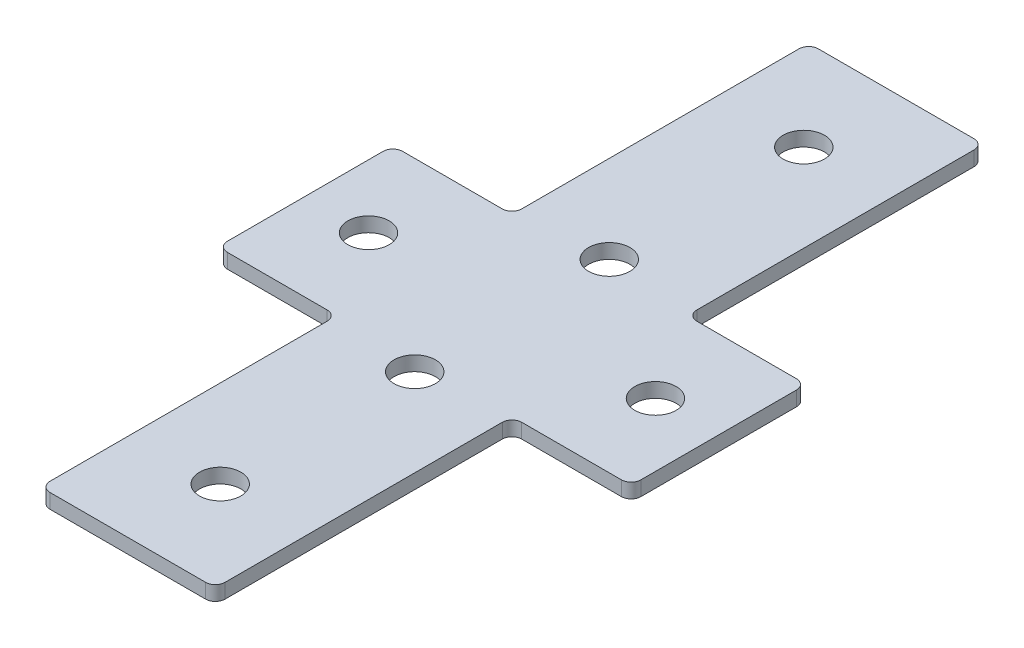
ISO-10303-21;
HEADER;
FILE_DESCRIPTION(('STEP AP214'),'2;1');
FILE_NAME('part.step','',(''),(''),'','','');
FILE_SCHEMA(('AUTOMOTIVE_DESIGN { 1 0 10303 214 1 1 1 1 }'));
ENDSEC;
DATA;
#1=APPLICATION_CONTEXT('core data for automotive mechanical design processes');
#2=APPLICATION_PROTOCOL_DEFINITION('international standard','automotive_design',2000,#1);
#3=PRODUCT_CONTEXT('',#1,'mechanical');
#4=PRODUCT('Part','Part','',(#3));
#5=PRODUCT_RELATED_PRODUCT_CATEGORY('part','',(#4));
#6=PRODUCT_DEFINITION_FORMATION('','',#4);
#7=PRODUCT_DEFINITION_CONTEXT('part definition',#1,'design');
#8=PRODUCT_DEFINITION('design','',#6,#7);
#9=PRODUCT_DEFINITION_SHAPE('','',#8);
#10=(LENGTH_UNIT() NAMED_UNIT(*) SI_UNIT(.MILLI.,.METRE.));
#11=(NAMED_UNIT(*) PLANE_ANGLE_UNIT() SI_UNIT($,.RADIAN.));
#12=(NAMED_UNIT(*) SI_UNIT($,.STERADIAN.) SOLID_ANGLE_UNIT());
#13=UNCERTAINTY_MEASURE_WITH_UNIT(LENGTH_MEASURE(1.E-05),#10,'distance_accuracy_value','');
#14=(GEOMETRIC_REPRESENTATION_CONTEXT(3) GLOBAL_UNCERTAINTY_ASSIGNED_CONTEXT((#13)) GLOBAL_UNIT_ASSIGNED_CONTEXT((#10,
#11,#12)) REPRESENTATION_CONTEXT('',''));
#15=CARTESIAN_POINT('',(0.,0.,0.));
#16=DIRECTION('',(0.,0.,1.));
#17=DIRECTION('',(1.,0.,0.));
#18=AXIS2_PLACEMENT_3D('',#15,#16,#17);
#19=CARTESIAN_POINT('',(0.,3.,0.));
#20=DIRECTION('',(0.,1.,0.));
#21=DIRECTION('',(0.,0.,1.));
#22=AXIS2_PLACEMENT_3D('',#19,#20,#21);
#23=PLANE('',#22);
#24=CARTESIAN_POINT('',(-29.5,3.,0.));
#25=DIRECTION('',(0.,1.,0.));
#26=DIRECTION('',(0.,0.,1.));
#27=AXIS2_PLACEMENT_3D('',#24,#25,#26);
#28=CIRCLE('',#27,4.25);
#29=CARTESIAN_POINT('',(-29.5,3.,4.25));
#30=VERTEX_POINT('',#29);
#31=EDGE_CURVE('E771',#30,#30,#28,.T.);
#32=ORIENTED_EDGE('',*,*,#31,.F.);
#33=EDGE_LOOP('',(#32));
#34=FACE_BOUND('',#33,.T.);
#35=CARTESIAN_POINT('',(0.,3.,19.9999999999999));
#36=DIRECTION('',(0.,1.,0.));
#37=DIRECTION('',(0.,0.,-1.));
#38=AXIS2_PLACEMENT_3D('',#35,#36,#37);
#39=CIRCLE('',#38,4.25);
#40=CARTESIAN_POINT('',(0.,3.,15.7499999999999));
#41=VERTEX_POINT('',#40);
#42=EDGE_CURVE('E760',#41,#41,#39,.T.);
#43=ORIENTED_EDGE('',*,*,#42,.F.);
#44=EDGE_LOOP('',(#43));
#45=FACE_BOUND('',#44,.T.);
#46=CARTESIAN_POINT('',(0.,3.,-59.9999999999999));
#47=DIRECTION('',(0.,1.,0.));
#48=DIRECTION('',(0.,0.,1.));
#49=AXIS2_PLACEMENT_3D('',#46,#47,#48);
#50=CIRCLE('',#49,4.25);
#51=CARTESIAN_POINT('',(0.,3.,-55.7499999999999));
#52=VERTEX_POINT('',#51);
#53=EDGE_CURVE('E379',#52,#52,#50,.T.);
#54=ORIENTED_EDGE('',*,*,#53,.F.);
#55=EDGE_LOOP('',(#54));
#56=FACE_BOUND('',#55,.T.);
#57=DIRECTION('',(0.,0.,1.));
#58=VECTOR('',#57,1.);
#59=CARTESIAN_POINT('',(-18.,3.,18.));
#60=LINE('',#59,#58);
#61=CARTESIAN_POINT('',(-18.,3.,20.));
#62=VERTEX_POINT('',#61);
#63=CARTESIAN_POINT('',(-18.,3.,77.));
#64=VERTEX_POINT('',#63);
#65=EDGE_CURVE('E394',#62,#64,#60,.T.);
#66=ORIENTED_EDGE('',*,*,#65,.T.);
#67=CARTESIAN_POINT('',(-16.,3.,77.));
#68=DIRECTION('',(0.,1.,0.));
#69=DIRECTION('',(0.,0.,1.));
#70=AXIS2_PLACEMENT_3D('',#67,#68,#69);
#71=CIRCLE('',#70,2.);
#72=CARTESIAN_POINT('',(-16.,3.,79.));
#73=VERTEX_POINT('',#72);
#74=EDGE_CURVE('E283',#64,#73,#71,.T.);
#75=ORIENTED_EDGE('',*,*,#74,.T.);
#76=DIRECTION('',(1.,0.,0.));
#77=VECTOR('',#76,1.);
#78=CARTESIAN_POINT('',(-18.,3.,79.));
#79=LINE('',#78,#77);
#80=CARTESIAN_POINT('',(16.0000000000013,3.,78.9999999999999));
#81=VERTEX_POINT('',#80);
#82=EDGE_CURVE('E219',#73,#81,#79,.T.);
#83=ORIENTED_EDGE('',*,*,#82,.T.);
#84=CARTESIAN_POINT('',(16.0000000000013,3.,76.9999999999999));
#85=DIRECTION('',(0.,1.,0.));
#86=DIRECTION('',(0.,0.,1.));
#87=AXIS2_PLACEMENT_3D('',#84,#85,#86);
#88=CIRCLE('',#87,2.);
#89=CARTESIAN_POINT('',(18.0000000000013,3.,76.9999999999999));
#90=VERTEX_POINT('',#89);
#91=EDGE_CURVE('E281',#81,#90,#88,.T.);
#92=ORIENTED_EDGE('',*,*,#91,.T.);
#93=DIRECTION('',(0.,0.,-1.));
#94=VECTOR('',#93,1.);
#95=CARTESIAN_POINT('',(18.0000000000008,3.,17.9999999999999));
#96=LINE('',#95,#94);
#97=CARTESIAN_POINT('',(18.0000000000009,3.,19.9999999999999));
#98=VERTEX_POINT('',#97);
#99=EDGE_CURVE('E399',#90,#98,#96,.T.);
#100=ORIENTED_EDGE('',*,*,#99,.T.);
#101=CARTESIAN_POINT('',(20.0000000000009,3.,19.9999999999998));
#102=DIRECTION('',(0.,1.,0.));
#103=DIRECTION('',(0.,0.,1.));
#104=AXIS2_PLACEMENT_3D('',#101,#102,#103);
#105=CIRCLE('',#104,2.);
#106=CARTESIAN_POINT('',(20.0000000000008,3.,17.9999999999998));
#107=VERTEX_POINT('',#106);
#108=EDGE_CURVE('E336',#98,#107,#105,.F.);
#109=ORIENTED_EDGE('',*,*,#108,.T.);
#110=DIRECTION('',(1.,0.,0.));
#111=VECTOR('',#110,1.);
#112=CARTESIAN_POINT('',(42.5000000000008,3.,17.9999999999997));
#113=LINE('',#112,#111);
#114=CARTESIAN_POINT('',(40.5000000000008,3.,17.9999999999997));
#115=VERTEX_POINT('',#114);
#116=EDGE_CURVE('E407',#107,#115,#113,.T.);
#117=ORIENTED_EDGE('',*,*,#116,.T.);
#118=CARTESIAN_POINT('',(40.5000000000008,3.,15.9999999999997));
#119=DIRECTION('',(0.,1.,0.));
#120=DIRECTION('',(0.,0.,1.));
#121=AXIS2_PLACEMENT_3D('',#118,#119,#120);
#122=CIRCLE('',#121,2.);
#123=CARTESIAN_POINT('',(42.5000000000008,3.,15.9999999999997));
#124=VERTEX_POINT('',#123);
#125=EDGE_CURVE('E279',#115,#124,#122,.T.);
#126=ORIENTED_EDGE('',*,*,#125,.T.);
#127=DIRECTION('',(0.,0.,-1.));
#128=VECTOR('',#127,1.);
#129=CARTESIAN_POINT('',(42.5000000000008,3.,17.9999999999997));
#130=LINE('',#129,#128);
#131=CARTESIAN_POINT('',(42.5000000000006,3.,-16.0000000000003));
#132=VERTEX_POINT('',#131);
#133=EDGE_CURVE('E370',#124,#132,#130,.T.);
#134=ORIENTED_EDGE('',*,*,#133,.T.);
#135=CARTESIAN_POINT('',(40.5000000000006,3.,-16.0000000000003));
#136=DIRECTION('',(0.,1.,0.));
#137=DIRECTION('',(0.,0.,1.));
#138=AXIS2_PLACEMENT_3D('',#135,#136,#137);
#139=CIRCLE('',#138,2.);
#140=CARTESIAN_POINT('',(40.5000000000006,3.,-18.0000000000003));
#141=VERTEX_POINT('',#140);
#142=EDGE_CURVE('E275',#132,#141,#139,.T.);
#143=ORIENTED_EDGE('',*,*,#142,.T.);
#144=DIRECTION('',(-1.,0.,0.));
#145=VECTOR('',#144,1.);
#146=CARTESIAN_POINT('',(42.5000000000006,3.,-18.0000000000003));
#147=LINE('',#146,#145);
#148=CARTESIAN_POINT('',(20.0000000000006,3.,-18.0000000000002));
#149=VERTEX_POINT('',#148);
#150=EDGE_CURVE('E363',#141,#149,#147,.T.);
#151=ORIENTED_EDGE('',*,*,#150,.T.);
#152=CARTESIAN_POINT('',(20.0000000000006,3.,-20.0000000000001));
#153=DIRECTION('',(0.,1.,0.));
#154=DIRECTION('',(0.,0.,1.));
#155=AXIS2_PLACEMENT_3D('',#152,#153,#154);
#156=CIRCLE('',#155,2.);
#157=CARTESIAN_POINT('',(18.0000000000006,3.,-20.0000000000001));
#158=VERTEX_POINT('',#157);
#159=EDGE_CURVE('E11',#149,#158,#156,.F.);
#160=ORIENTED_EDGE('',*,*,#159,.T.);
#161=DIRECTION('',(0.,0.,-1.));
#162=VECTOR('',#161,1.);
#163=CARTESIAN_POINT('',(18.0000000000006,3.,-18.0000000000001));
#164=LINE('',#163,#162);
#165=CARTESIAN_POINT('',(18.0000000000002,3.,-77.0000000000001));
#166=VERTEX_POINT('',#165);
#167=EDGE_CURVE('E361',#158,#166,#164,.T.);
#168=ORIENTED_EDGE('',*,*,#167,.T.);
#169=CARTESIAN_POINT('',(16.0000000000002,3.,-77.0000000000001));
#170=DIRECTION('',(0.,1.,0.));
#171=DIRECTION('',(0.,0.,1.));
#172=AXIS2_PLACEMENT_3D('',#169,#170,#171);
#173=CIRCLE('',#172,2.);
#174=CARTESIAN_POINT('',(16.0000000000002,3.,-79.0000000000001));
#175=VERTEX_POINT('',#174);
#176=EDGE_CURVE('E271',#166,#175,#173,.T.);
#177=ORIENTED_EDGE('',*,*,#176,.T.);
#178=DIRECTION('',(-1.,0.,0.));
#179=VECTOR('',#178,1.);
#180=CARTESIAN_POINT('',(-18.,3.,-79.));
#181=LINE('',#180,#179);
#182=CARTESIAN_POINT('',(-16.,3.,-79.));
#183=VERTEX_POINT('',#182);
#184=EDGE_CURVE('E367',#175,#183,#181,.T.);
#185=ORIENTED_EDGE('',*,*,#184,.T.);
#186=CARTESIAN_POINT('',(-16.,3.,-77.));
#187=DIRECTION('',(0.,1.,0.));
#188=DIRECTION('',(0.,0.,1.));
#189=AXIS2_PLACEMENT_3D('',#186,#187,#188);
#190=CIRCLE('',#189,2.);
#191=CARTESIAN_POINT('',(-18.,3.,-77.));
#192=VERTEX_POINT('',#191);
#193=EDGE_CURVE('E59',#183,#192,#190,.T.);
#194=ORIENTED_EDGE('',*,*,#193,.T.);
#195=DIRECTION('',(0.,0.,1.));
#196=VECTOR('',#195,1.);
#197=CARTESIAN_POINT('',(-18.,3.,-18.));
#198=LINE('',#197,#196);
#199=CARTESIAN_POINT('',(-18.,3.,-20.));
#200=VERTEX_POINT('',#199);
#201=EDGE_CURVE('E253',#192,#200,#198,.T.);
#202=ORIENTED_EDGE('',*,*,#201,.T.);
#203=CARTESIAN_POINT('',(-20.,3.,-20.));
#204=DIRECTION('',(0.,1.,0.));
#205=DIRECTION('',(0.,0.,1.));
#206=AXIS2_PLACEMENT_3D('',#203,#204,#205);
#207=CIRCLE('',#206,2.);
#208=CARTESIAN_POINT('',(-20.,3.,-18.));
#209=VERTEX_POINT('',#208);
#210=EDGE_CURVE('E344',#200,#209,#207,.F.);
#211=ORIENTED_EDGE('',*,*,#210,.T.);
#212=DIRECTION('',(-1.,0.,0.));
#213=VECTOR('',#212,1.);
#214=CARTESIAN_POINT('',(-42.5,3.,-18.));
#215=LINE('',#214,#213);
#216=CARTESIAN_POINT('',(-40.5,3.,-18.));
#217=VERTEX_POINT('',#216);
#218=EDGE_CURVE('E252',#209,#217,#215,.T.);
#219=ORIENTED_EDGE('',*,*,#218,.T.);
#220=CARTESIAN_POINT('',(-40.5,3.,-16.));
#221=DIRECTION('',(0.,1.,0.));
#222=DIRECTION('',(0.,0.,1.));
#223=AXIS2_PLACEMENT_3D('',#220,#221,#222);
#224=CIRCLE('',#223,2.);
#225=CARTESIAN_POINT('',(-42.5,3.,-16.));
#226=VERTEX_POINT('',#225);
#227=EDGE_CURVE('E273',#217,#226,#224,.T.);
#228=ORIENTED_EDGE('',*,*,#227,.T.);
#229=DIRECTION('',(0.,0.,1.));
#230=VECTOR('',#229,1.);
#231=CARTESIAN_POINT('',(-42.5,3.,18.));
#232=LINE('',#231,#230);
#233=CARTESIAN_POINT('',(-42.5,3.,16.));
#234=VERTEX_POINT('',#233);
#235=EDGE_CURVE('E401',#226,#234,#232,.T.);
#236=ORIENTED_EDGE('',*,*,#235,.T.);
#237=CARTESIAN_POINT('',(-40.5,3.,16.));
#238=DIRECTION('',(0.,1.,0.));
#239=DIRECTION('',(0.,0.,1.));
#240=AXIS2_PLACEMENT_3D('',#237,#238,#239);
#241=CIRCLE('',#240,2.);
#242=CARTESIAN_POINT('',(-40.5,3.,18.));
#243=VERTEX_POINT('',#242);
#244=EDGE_CURVE('E277',#234,#243,#241,.T.);
#245=ORIENTED_EDGE('',*,*,#244,.T.);
#246=DIRECTION('',(1.,0.,0.));
#247=VECTOR('',#246,1.);
#248=CARTESIAN_POINT('',(-42.5,3.,18.));
#249=LINE('',#248,#247);
#250=CARTESIAN_POINT('',(-20.,3.,18.));
#251=VERTEX_POINT('',#250);
#252=EDGE_CURVE('E395',#243,#251,#249,.T.);
#253=ORIENTED_EDGE('',*,*,#252,.T.);
#254=CARTESIAN_POINT('',(-20.,3.,20.));
#255=DIRECTION('',(0.,1.,0.));
#256=DIRECTION('',(0.,0.,1.));
#257=AXIS2_PLACEMENT_3D('',#254,#255,#256);
#258=CIRCLE('',#257,2.);
#259=EDGE_CURVE('E340',#251,#62,#258,.F.);
#260=ORIENTED_EDGE('',*,*,#259,.T.);
#261=EDGE_LOOP('',(#66,#75,#83,#92,#100,#109,#117,#126,#134,#143,#151,#160,#168,#177,#185,#194,
#202,#211,#219,#228,#236,#245,#253,#260));
#262=FACE_BOUND('',#261,.T.);
#263=CARTESIAN_POINT('',(0.,3.,-19.9999999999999));
#264=DIRECTION('',(0.,1.,0.));
#265=DIRECTION('',(0.,0.,1.));
#266=AXIS2_PLACEMENT_3D('',#263,#264,#265);
#267=CIRCLE('',#266,4.25);
#268=CARTESIAN_POINT('',(0.,3.,-15.7499999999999));
#269=VERTEX_POINT('',#268);
#270=EDGE_CURVE('E746',#269,#269,#267,.T.);
#271=ORIENTED_EDGE('',*,*,#270,.F.);
#272=EDGE_LOOP('',(#271));
#273=FACE_BOUND('',#272,.T.);
#274=CARTESIAN_POINT('',(0.,3.,59.9999999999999));
#275=DIRECTION('',(0.,1.,0.));
#276=DIRECTION('',(0.,0.,-1.));
#277=AXIS2_PLACEMENT_3D('',#274,#275,#276);
#278=CIRCLE('',#277,4.25);
#279=CARTESIAN_POINT('',(0.,3.,55.7499999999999));
#280=VERTEX_POINT('',#279);
#281=EDGE_CURVE('E765',#280,#280,#278,.T.);
#282=ORIENTED_EDGE('',*,*,#281,.F.);
#283=EDGE_LOOP('',(#282));
#284=FACE_BOUND('',#283,.T.);
#285=CARTESIAN_POINT('',(29.5000000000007,3.,-1.94289029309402E-13));
#286=DIRECTION('',(0.,1.,0.));
#287=DIRECTION('',(0.,0.,-1.));
#288=AXIS2_PLACEMENT_3D('',#285,#286,#287);
#289=CIRCLE('',#288,4.25);
#290=CARTESIAN_POINT('',(29.5000000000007,3.,-4.2500000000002));
#291=VERTEX_POINT('',#290);
#292=EDGE_CURVE('E777',#291,#291,#289,.T.);
#293=ORIENTED_EDGE('',*,*,#292,.F.);
#294=EDGE_LOOP('',(#293));
#295=FACE_BOUND('',#294,.T.);
#296=ADVANCED_FACE('F37',(#34,#45,#56,#262,#273,#284,#295),#23,.T.);
#297=CARTESIAN_POINT('',(0.,0.,0.));
#298=DIRECTION('',(0.,1.,0.));
#299=DIRECTION('',(0.,0.,1.));
#300=AXIS2_PLACEMENT_3D('',#297,#298,#299);
#301=PLANE('',#300);
#302=CARTESIAN_POINT('',(-29.5,0.,0.));
#303=DIRECTION('',(0.,1.,0.));
#304=DIRECTION('',(0.,0.,1.));
#305=AXIS2_PLACEMENT_3D('',#302,#303,#304);
#306=CIRCLE('',#305,4.25);
#307=CARTESIAN_POINT('',(-29.5,0.,4.25));
#308=VERTEX_POINT('',#307);
#309=EDGE_CURVE('E774',#308,#308,#306,.T.);
#310=ORIENTED_EDGE('',*,*,#309,.T.);
#311=EDGE_LOOP('',(#310));
#312=FACE_BOUND('',#311,.T.);
#313=CARTESIAN_POINT('',(0.,0.,19.9999999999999));
#314=DIRECTION('',(0.,1.,0.));
#315=DIRECTION('',(0.,0.,-1.));
#316=AXIS2_PLACEMENT_3D('',#313,#314,#315);
#317=CIRCLE('',#316,4.25);
#318=CARTESIAN_POINT('',(0.,0.,15.7499999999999));
#319=VERTEX_POINT('',#318);
#320=EDGE_CURVE('E762',#319,#319,#317,.T.);
#321=ORIENTED_EDGE('',*,*,#320,.T.);
#322=EDGE_LOOP('',(#321));
#323=FACE_BOUND('',#322,.T.);
#324=CARTESIAN_POINT('',(0.,0.,-59.9999999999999));
#325=DIRECTION('',(0.,1.,0.));
#326=DIRECTION('',(0.,0.,1.));
#327=AXIS2_PLACEMENT_3D('',#324,#325,#326);
#328=CIRCLE('',#327,4.25);
#329=CARTESIAN_POINT('',(0.,0.,-55.7499999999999));
#330=VERTEX_POINT('',#329);
#331=EDGE_CURVE('E744',#330,#330,#328,.T.);
#332=ORIENTED_EDGE('',*,*,#331,.T.);
#333=EDGE_LOOP('',(#332));
#334=FACE_BOUND('',#333,.T.);
#335=DIRECTION('',(1.,0.,0.));
#336=VECTOR('',#335,1.);
#337=CARTESIAN_POINT('',(-18.,0.,79.));
#338=LINE('',#337,#336);
#339=CARTESIAN_POINT('',(-16.,0.,79.));
#340=VERTEX_POINT('',#339);
#341=CARTESIAN_POINT('',(16.0000000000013,0.,78.9999999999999));
#342=VERTEX_POINT('',#341);
#343=EDGE_CURVE('E216',#340,#342,#338,.T.);
#344=ORIENTED_EDGE('',*,*,#343,.F.);
#345=CARTESIAN_POINT('',(-16.,0.,77.));
#346=DIRECTION('',(0.,1.,0.));
#347=DIRECTION('',(0.,0.,1.));
#348=AXIS2_PLACEMENT_3D('',#345,#346,#347);
#349=CIRCLE('',#348,2.);
#350=CARTESIAN_POINT('',(-18.,0.,77.));
#351=VERTEX_POINT('',#350);
#352=EDGE_CURVE('E199',#340,#351,#349,.F.);
#353=ORIENTED_EDGE('',*,*,#352,.T.);
#354=DIRECTION('',(0.,0.,1.));
#355=VECTOR('',#354,1.);
#356=CARTESIAN_POINT('',(-18.,0.,18.));
#357=LINE('',#356,#355);
#358=CARTESIAN_POINT('',(-18.,0.,20.));
#359=VERTEX_POINT('',#358);
#360=EDGE_CURVE('E227',#359,#351,#357,.T.);
#361=ORIENTED_EDGE('',*,*,#360,.F.);
#362=CARTESIAN_POINT('',(-20.,0.,20.));
#363=DIRECTION('',(0.,1.,0.));
#364=DIRECTION('',(0.,0.,1.));
#365=AXIS2_PLACEMENT_3D('',#362,#363,#364);
#366=CIRCLE('',#365,2.);
#367=CARTESIAN_POINT('',(-20.,0.,18.));
#368=VERTEX_POINT('',#367);
#369=EDGE_CURVE('E338',#359,#368,#366,.T.);
#370=ORIENTED_EDGE('',*,*,#369,.T.);
#371=DIRECTION('',(1.,0.,0.));
#372=VECTOR('',#371,1.);
#373=CARTESIAN_POINT('',(-42.5,0.,18.));
#374=LINE('',#373,#372);
#375=CARTESIAN_POINT('',(-40.5,0.,18.));
#376=VERTEX_POINT('',#375);
#377=EDGE_CURVE('E232',#376,#368,#374,.T.);
#378=ORIENTED_EDGE('',*,*,#377,.F.);
#379=CARTESIAN_POINT('',(-40.5,0.,16.));
#380=DIRECTION('',(0.,1.,0.));
#381=DIRECTION('',(0.,0.,1.));
#382=AXIS2_PLACEMENT_3D('',#379,#380,#381);
#383=CIRCLE('',#382,2.);
#384=CARTESIAN_POINT('',(-42.5,0.,16.));
#385=VERTEX_POINT('',#384);
#386=EDGE_CURVE('E262',#376,#385,#383,.F.);
#387=ORIENTED_EDGE('',*,*,#386,.T.);
#388=DIRECTION('',(0.,0.,1.));
#389=VECTOR('',#388,1.);
#390=CARTESIAN_POINT('',(-42.5,0.,18.));
#391=LINE('',#390,#389);
#392=CARTESIAN_POINT('',(-42.5,0.,-16.));
#393=VERTEX_POINT('',#392);
#394=EDGE_CURVE('E378',#393,#385,#391,.T.);
#395=ORIENTED_EDGE('',*,*,#394,.F.);
#396=CARTESIAN_POINT('',(-40.5,0.,-16.));
#397=DIRECTION('',(0.,1.,0.));
#398=DIRECTION('',(0.,0.,1.));
#399=AXIS2_PLACEMENT_3D('',#396,#397,#398);
#400=CIRCLE('',#399,2.);
#401=CARTESIAN_POINT('',(-40.5,0.,-18.));
#402=VERTEX_POINT('',#401);
#403=EDGE_CURVE('E258',#393,#402,#400,.F.);
#404=ORIENTED_EDGE('',*,*,#403,.T.);
#405=DIRECTION('',(-1.,0.,0.));
#406=VECTOR('',#405,1.);
#407=CARTESIAN_POINT('',(-42.5,0.,-18.));
#408=LINE('',#407,#406);
#409=CARTESIAN_POINT('',(-20.,0.,-18.));
#410=VERTEX_POINT('',#409);
#411=EDGE_CURVE('E375',#410,#402,#408,.T.);
#412=ORIENTED_EDGE('',*,*,#411,.F.);
#413=CARTESIAN_POINT('',(-20.,0.,-20.));
#414=DIRECTION('',(0.,1.,0.));
#415=DIRECTION('',(0.,0.,1.));
#416=AXIS2_PLACEMENT_3D('',#413,#414,#415);
#417=CIRCLE('',#416,2.);
#418=CARTESIAN_POINT('',(-18.,0.,-20.));
#419=VERTEX_POINT('',#418);
#420=EDGE_CURVE('E342',#410,#419,#417,.T.);
#421=ORIENTED_EDGE('',*,*,#420,.T.);
#422=DIRECTION('',(0.,0.,1.));
#423=VECTOR('',#422,1.);
#424=CARTESIAN_POINT('',(-18.,0.,-18.));
#425=LINE('',#424,#423);
#426=CARTESIAN_POINT('',(-18.,0.,-77.));
#427=VERTEX_POINT('',#426);
#428=EDGE_CURVE('E250',#427,#419,#425,.T.);
#429=ORIENTED_EDGE('',*,*,#428,.F.);
#430=CARTESIAN_POINT('',(-16.,0.,-77.));
#431=DIRECTION('',(0.,1.,0.));
#432=DIRECTION('',(0.,0.,1.));
#433=AXIS2_PLACEMENT_3D('',#430,#431,#432);
#434=CIRCLE('',#433,2.);
#435=CARTESIAN_POINT('',(-16.,0.,-79.));
#436=VERTEX_POINT('',#435);
#437=EDGE_CURVE('E220',#427,#436,#434,.F.);
#438=ORIENTED_EDGE('',*,*,#437,.T.);
#439=DIRECTION('',(-1.,0.,0.));
#440=VECTOR('',#439,1.);
#441=CARTESIAN_POINT('',(-18.,0.,-79.));
#442=LINE('',#441,#440);
#443=CARTESIAN_POINT('',(16.0000000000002,0.,-79.0000000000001));
#444=VERTEX_POINT('',#443);
#445=EDGE_CURVE('E247',#444,#436,#442,.T.);
#446=ORIENTED_EDGE('',*,*,#445,.F.);
#447=CARTESIAN_POINT('',(16.0000000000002,0.,-77.0000000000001));
#448=DIRECTION('',(0.,1.,0.));
#449=DIRECTION('',(0.,0.,1.));
#450=AXIS2_PLACEMENT_3D('',#447,#448,#449);
#451=CIRCLE('',#450,2.);
#452=CARTESIAN_POINT('',(18.0000000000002,0.,-77.0000000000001));
#453=VERTEX_POINT('',#452);
#454=EDGE_CURVE('E256',#444,#453,#451,.F.);
#455=ORIENTED_EDGE('',*,*,#454,.T.);
#456=DIRECTION('',(0.,0.,-1.));
#457=VECTOR('',#456,1.);
#458=CARTESIAN_POINT('',(18.0000000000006,0.,-18.0000000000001));
#459=LINE('',#458,#457);
#460=CARTESIAN_POINT('',(18.0000000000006,0.,-20.0000000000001));
#461=VERTEX_POINT('',#460);
#462=EDGE_CURVE('E244',#461,#453,#459,.T.);
#463=ORIENTED_EDGE('',*,*,#462,.F.);
#464=CARTESIAN_POINT('',(20.0000000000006,0.,-20.0000000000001));
#465=DIRECTION('',(0.,1.,0.));
#466=DIRECTION('',(0.,0.,1.));
#467=AXIS2_PLACEMENT_3D('',#464,#465,#466);
#468=CIRCLE('',#467,2.);
#469=CARTESIAN_POINT('',(20.0000000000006,0.,-18.0000000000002));
#470=VERTEX_POINT('',#469);
#471=EDGE_CURVE('E45',#461,#470,#468,.T.);
#472=ORIENTED_EDGE('',*,*,#471,.T.);
#473=DIRECTION('',(-1.,0.,0.));
#474=VECTOR('',#473,1.);
#475=CARTESIAN_POINT('',(42.5000000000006,0.,-18.0000000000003));
#476=LINE('',#475,#474);
#477=CARTESIAN_POINT('',(40.5000000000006,0.,-18.0000000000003));
#478=VERTEX_POINT('',#477);
#479=EDGE_CURVE('E241',#478,#470,#476,.T.);
#480=ORIENTED_EDGE('',*,*,#479,.F.);
#481=CARTESIAN_POINT('',(40.5000000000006,0.,-16.0000000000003));
#482=DIRECTION('',(0.,1.,0.));
#483=DIRECTION('',(0.,0.,1.));
#484=AXIS2_PLACEMENT_3D('',#481,#482,#483);
#485=CIRCLE('',#484,2.);
#486=CARTESIAN_POINT('',(42.5000000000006,0.,-16.0000000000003));
#487=VERTEX_POINT('',#486);
#488=EDGE_CURVE('E260',#478,#487,#485,.F.);
#489=ORIENTED_EDGE('',*,*,#488,.T.);
#490=DIRECTION('',(0.,0.,-1.));
#491=VECTOR('',#490,1.);
#492=CARTESIAN_POINT('',(42.5000000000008,0.,17.9999999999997));
#493=LINE('',#492,#491);
#494=CARTESIAN_POINT('',(42.5000000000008,0.,15.9999999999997));
#495=VERTEX_POINT('',#494);
#496=EDGE_CURVE('E238',#495,#487,#493,.T.);
#497=ORIENTED_EDGE('',*,*,#496,.F.);
#498=CARTESIAN_POINT('',(40.5000000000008,0.,15.9999999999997));
#499=DIRECTION('',(0.,1.,0.));
#500=DIRECTION('',(0.,0.,1.));
#501=AXIS2_PLACEMENT_3D('',#498,#499,#500);
#502=CIRCLE('',#501,2.);
#503=CARTESIAN_POINT('',(40.5000000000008,0.,17.9999999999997));
#504=VERTEX_POINT('',#503);
#505=EDGE_CURVE('E264',#495,#504,#502,.F.);
#506=ORIENTED_EDGE('',*,*,#505,.T.);
#507=DIRECTION('',(1.,0.,0.));
#508=VECTOR('',#507,1.);
#509=CARTESIAN_POINT('',(42.5000000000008,0.,17.9999999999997));
#510=LINE('',#509,#508);
#511=CARTESIAN_POINT('',(20.0000000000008,0.,17.9999999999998));
#512=VERTEX_POINT('',#511);
#513=EDGE_CURVE('E230',#512,#504,#510,.T.);
#514=ORIENTED_EDGE('',*,*,#513,.F.);
#515=CARTESIAN_POINT('',(20.0000000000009,0.,19.9999999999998));
#516=DIRECTION('',(0.,1.,0.));
#517=DIRECTION('',(0.,0.,1.));
#518=AXIS2_PLACEMENT_3D('',#515,#516,#517);
#519=CIRCLE('',#518,2.);
#520=CARTESIAN_POINT('',(18.0000000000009,0.,19.9999999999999));
#521=VERTEX_POINT('',#520);
#522=EDGE_CURVE('E334',#512,#521,#519,.T.);
#523=ORIENTED_EDGE('',*,*,#522,.T.);
#524=DIRECTION('',(0.,0.,-1.));
#525=VECTOR('',#524,1.);
#526=CARTESIAN_POINT('',(18.0000000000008,0.,17.9999999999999));
#527=LINE('',#526,#525);
#528=CARTESIAN_POINT('',(18.0000000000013,0.,76.9999999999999));
#529=VERTEX_POINT('',#528);
#530=EDGE_CURVE('E226',#529,#521,#527,.T.);
#531=ORIENTED_EDGE('',*,*,#530,.F.);
#532=CARTESIAN_POINT('',(16.0000000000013,0.,76.9999999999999));
#533=DIRECTION('',(0.,1.,0.));
#534=DIRECTION('',(0.,0.,1.));
#535=AXIS2_PLACEMENT_3D('',#532,#533,#534);
#536=CIRCLE('',#535,2.);
#537=EDGE_CURVE('E210',#529,#342,#536,.F.);
#538=ORIENTED_EDGE('',*,*,#537,.T.);
#539=EDGE_LOOP('',(#344,#353,#361,#370,#378,#387,#395,#404,#412,#421,#429,#438,#446,#455,#463,
#472,#480,#489,#497,#506,#514,#523,#531,#538));
#540=FACE_BOUND('',#539,.T.);
#541=CARTESIAN_POINT('',(0.,0.,-19.9999999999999));
#542=DIRECTION('',(0.,1.,0.));
#543=DIRECTION('',(0.,0.,1.));
#544=AXIS2_PLACEMENT_3D('',#541,#542,#543);
#545=CIRCLE('',#544,4.25);
#546=CARTESIAN_POINT('',(0.,0.,-15.7499999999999));
#547=VERTEX_POINT('',#546);
#548=EDGE_CURVE('E750',#547,#547,#545,.T.);
#549=ORIENTED_EDGE('',*,*,#548,.T.);
#550=EDGE_LOOP('',(#549));
#551=FACE_BOUND('',#550,.T.);
#552=CARTESIAN_POINT('',(0.,0.,59.9999999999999));
#553=DIRECTION('',(0.,1.,0.));
#554=DIRECTION('',(0.,0.,-1.));
#555=AXIS2_PLACEMENT_3D('',#552,#553,#554);
#556=CIRCLE('',#555,4.25);
#557=CARTESIAN_POINT('',(0.,0.,55.7499999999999));
#558=VERTEX_POINT('',#557);
#559=EDGE_CURVE('E768',#558,#558,#556,.T.);
#560=ORIENTED_EDGE('',*,*,#559,.T.);
#561=EDGE_LOOP('',(#560));
#562=FACE_BOUND('',#561,.T.);
#563=CARTESIAN_POINT('',(29.5000000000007,0.,-1.94289029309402E-13));
#564=DIRECTION('',(0.,1.,0.));
#565=DIRECTION('',(0.,0.,-1.));
#566=AXIS2_PLACEMENT_3D('',#563,#564,#565);
#567=CIRCLE('',#566,4.25);
#568=CARTESIAN_POINT('',(29.5000000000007,0.,-4.2500000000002));
#569=VERTEX_POINT('',#568);
#570=EDGE_CURVE('E780',#569,#569,#567,.T.);
#571=ORIENTED_EDGE('',*,*,#570,.T.);
#572=EDGE_LOOP('',(#571));
#573=FACE_BOUND('',#572,.T.);
#574=ADVANCED_FACE('F223',(#312,#323,#334,#540,#551,#562,#573),#301,.F.);
#575=CARTESIAN_POINT('',(-42.5,3.,-18.));
#576=DIRECTION('',(0.,0.,1.));
#577=DIRECTION('',(1.,0.,0.));
#578=AXIS2_PLACEMENT_3D('',#575,#576,#577);
#579=PLANE('',#578);
#580=ORIENTED_EDGE('',*,*,#218,.F.);
#581=DIRECTION('',(0.,-1.,0.));
#582=VECTOR('',#581,1.);
#583=CARTESIAN_POINT('',(-20.,0.,-18.));
#584=LINE('',#583,#582);
#585=EDGE_CURVE('E312',#209,#410,#584,.T.);
#586=ORIENTED_EDGE('',*,*,#585,.T.);
#587=ORIENTED_EDGE('',*,*,#411,.T.);
#588=DIRECTION('',(0.,-1.,0.));
#589=VECTOR('',#588,1.);
#590=CARTESIAN_POINT('',(-40.5,3.,-18.));
#591=LINE('',#590,#589);
#592=EDGE_CURVE('E310',#402,#217,#591,.F.);
#593=ORIENTED_EDGE('',*,*,#592,.T.);
#594=EDGE_LOOP('',(#580,#586,#587,#593));
#595=FACE_BOUND('',#594,.T.);
#596=ADVANCED_FACE('F454',(#595),#579,.F.);
#597=CARTESIAN_POINT('',(-42.5,3.,18.));
#598=DIRECTION('',(1.,0.,0.));
#599=DIRECTION('',(0.,0.,-1.));
#600=AXIS2_PLACEMENT_3D('',#597,#598,#599);
#601=PLANE('',#600);
#602=ORIENTED_EDGE('',*,*,#394,.T.);
#603=DIRECTION('',(0.,-1.,0.));
#604=VECTOR('',#603,1.);
#605=CARTESIAN_POINT('',(-42.5,3.,16.));
#606=LINE('',#605,#604);
#607=EDGE_CURVE('E308',#385,#234,#606,.F.);
#608=ORIENTED_EDGE('',*,*,#607,.T.);
#609=ORIENTED_EDGE('',*,*,#235,.F.);
#610=DIRECTION('',(0.,-1.,0.));
#611=VECTOR('',#610,1.);
#612=CARTESIAN_POINT('',(-42.5,3.,-16.));
#613=LINE('',#612,#611);
#614=EDGE_CURVE('E305',#226,#393,#613,.T.);
#615=ORIENTED_EDGE('',*,*,#614,.T.);
#616=EDGE_LOOP('',(#602,#608,#609,#615));
#617=FACE_BOUND('',#616,.T.);
#618=ADVANCED_FACE('F486',(#617),#601,.F.);
#619=CARTESIAN_POINT('',(-42.5,3.,18.));
#620=DIRECTION('',(0.,0.,-1.));
#621=DIRECTION('',(-1.,0.,0.));
#622=AXIS2_PLACEMENT_3D('',#619,#620,#621);
#623=PLANE('',#622);
#624=ORIENTED_EDGE('',*,*,#377,.T.);
#625=DIRECTION('',(0.,-1.,0.));
#626=VECTOR('',#625,1.);
#627=CARTESIAN_POINT('',(-20.,3.,18.));
#628=LINE('',#627,#626);
#629=EDGE_CURVE('E303',#368,#251,#628,.F.);
#630=ORIENTED_EDGE('',*,*,#629,.T.);
#631=ORIENTED_EDGE('',*,*,#252,.F.);
#632=DIRECTION('',(0.,-1.,0.));
#633=VECTOR('',#632,1.);
#634=CARTESIAN_POINT('',(-40.5,3.,18.));
#635=LINE('',#634,#633);
#636=EDGE_CURVE('E300',#243,#376,#635,.T.);
#637=ORIENTED_EDGE('',*,*,#636,.T.);
#638=EDGE_LOOP('',(#624,#630,#631,#637));
#639=FACE_BOUND('',#638,.T.);
#640=ADVANCED_FACE('F385',(#639),#623,.F.);
#641=CARTESIAN_POINT('',(-18.,3.,18.));
#642=DIRECTION('',(1.,0.,0.));
#643=DIRECTION('',(0.,0.,-1.));
#644=AXIS2_PLACEMENT_3D('',#641,#642,#643);
#645=PLANE('',#644);
#646=ORIENTED_EDGE('',*,*,#360,.T.);
#647=DIRECTION('',(0.,-1.,0.));
#648=VECTOR('',#647,1.);
#649=CARTESIAN_POINT('',(-18.,3.,77.));
#650=LINE('',#649,#648);
#651=EDGE_CURVE('E204',#351,#64,#650,.F.);
#652=ORIENTED_EDGE('',*,*,#651,.T.);
#653=ORIENTED_EDGE('',*,*,#65,.F.);
#654=DIRECTION('',(0.,-1.,0.));
#655=VECTOR('',#654,1.);
#656=CARTESIAN_POINT('',(-18.,0.,20.));
#657=LINE('',#656,#655);
#658=EDGE_CURVE('E209',#62,#359,#657,.T.);
#659=ORIENTED_EDGE('',*,*,#658,.T.);
#660=EDGE_LOOP('',(#646,#652,#653,#659));
#661=FACE_BOUND('',#660,.T.);
#662=ADVANCED_FACE('F397',(#661),#645,.F.);
#663=CARTESIAN_POINT('',(-18.,3.,79.));
#664=DIRECTION('',(0.,0.,-1.));
#665=DIRECTION('',(-1.,0.,0.));
#666=AXIS2_PLACEMENT_3D('',#663,#664,#665);
#667=PLANE('',#666);
#668=ORIENTED_EDGE('',*,*,#82,.F.);
#669=DIRECTION('',(0.,-1.,0.));
#670=VECTOR('',#669,1.);
#671=CARTESIAN_POINT('',(-16.,3.,79.));
#672=LINE('',#671,#670);
#673=EDGE_CURVE('E203',#73,#340,#672,.T.);
#674=ORIENTED_EDGE('',*,*,#673,.T.);
#675=ORIENTED_EDGE('',*,*,#343,.T.);
#676=DIRECTION('',(0.,-1.,0.));
#677=VECTOR('',#676,1.);
#678=CARTESIAN_POINT('',(16.0000000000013,3.,78.9999999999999));
#679=LINE('',#678,#677);
#680=EDGE_CURVE('E221',#342,#81,#679,.F.);
#681=ORIENTED_EDGE('',*,*,#680,.T.);
#682=EDGE_LOOP('',(#668,#674,#675,#681));
#683=FACE_BOUND('',#682,.T.);
#684=ADVANCED_FACE('F215',(#683),#667,.F.);
#685=CARTESIAN_POINT('',(18.0000000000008,3.,17.9999999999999));
#686=DIRECTION('',(-1.,0.,0.));
#687=DIRECTION('',(0.,0.,1.));
#688=AXIS2_PLACEMENT_3D('',#685,#686,#687);
#689=PLANE('',#688);
#690=ORIENTED_EDGE('',*,*,#99,.F.);
#691=DIRECTION('',(0.,-1.,0.));
#692=VECTOR('',#691,1.);
#693=CARTESIAN_POINT('',(18.0000000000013,3.,76.9999999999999));
#694=LINE('',#693,#692);
#695=EDGE_CURVE('E287',#90,#529,#694,.T.);
#696=ORIENTED_EDGE('',*,*,#695,.T.);
#697=ORIENTED_EDGE('',*,*,#530,.T.);
#698=DIRECTION('',(0.,-1.,0.));
#699=VECTOR('',#698,1.);
#700=CARTESIAN_POINT('',(18.0000000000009,3.,19.9999999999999));
#701=LINE('',#700,#699);
#702=EDGE_CURVE('E285',#521,#98,#701,.F.);
#703=ORIENTED_EDGE('',*,*,#702,.T.);
#704=EDGE_LOOP('',(#690,#696,#697,#703));
#705=FACE_BOUND('',#704,.T.);
#706=ADVANCED_FACE('F434',(#705),#689,.F.);
#707=CARTESIAN_POINT('',(42.5000000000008,3.,17.9999999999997));
#708=DIRECTION('',(0.,0.,-1.));
#709=DIRECTION('',(-1.,0.,0.));
#710=AXIS2_PLACEMENT_3D('',#707,#708,#709);
#711=PLANE('',#710);
#712=ORIENTED_EDGE('',*,*,#513,.T.);
#713=DIRECTION('',(0.,-1.,0.));
#714=VECTOR('',#713,1.);
#715=CARTESIAN_POINT('',(40.5000000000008,3.,17.9999999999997));
#716=LINE('',#715,#714);
#717=EDGE_CURVE('E298',#504,#115,#716,.F.);
#718=ORIENTED_EDGE('',*,*,#717,.T.);
#719=ORIENTED_EDGE('',*,*,#116,.F.);
#720=DIRECTION('',(0.,-1.,0.));
#721=VECTOR('',#720,1.);
#722=CARTESIAN_POINT('',(20.0000000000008,0.,17.9999999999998));
#723=LINE('',#722,#721);
#724=EDGE_CURVE('E295',#107,#512,#723,.T.);
#725=ORIENTED_EDGE('',*,*,#724,.T.);
#726=EDGE_LOOP('',(#712,#718,#719,#725));
#727=FACE_BOUND('',#726,.T.);
#728=ADVANCED_FACE('F425',(#727),#711,.F.);
#729=CARTESIAN_POINT('',(42.5000000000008,3.,17.9999999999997));
#730=DIRECTION('',(-1.,0.,0.));
#731=DIRECTION('',(0.,0.,1.));
#732=AXIS2_PLACEMENT_3D('',#729,#730,#731);
#733=PLANE('',#732);
#734=ORIENTED_EDGE('',*,*,#133,.F.);
#735=DIRECTION('',(0.,-1.,0.));
#736=VECTOR('',#735,1.);
#737=CARTESIAN_POINT('',(42.5000000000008,3.,15.9999999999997));
#738=LINE('',#737,#736);
#739=EDGE_CURVE('E292',#124,#495,#738,.T.);
#740=ORIENTED_EDGE('',*,*,#739,.T.);
#741=ORIENTED_EDGE('',*,*,#496,.T.);
#742=DIRECTION('',(0.,-1.,0.));
#743=VECTOR('',#742,1.);
#744=CARTESIAN_POINT('',(42.5000000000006,3.,-16.0000000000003));
#745=LINE('',#744,#743);
#746=EDGE_CURVE('E290',#487,#132,#745,.F.);
#747=ORIENTED_EDGE('',*,*,#746,.T.);
#748=EDGE_LOOP('',(#734,#740,#741,#747));
#749=FACE_BOUND('',#748,.T.);
#750=ADVANCED_FACE('F419',(#749),#733,.F.);
#751=CARTESIAN_POINT('',(42.5000000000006,3.,-18.0000000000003));
#752=DIRECTION('',(0.,0.,1.));
#753=DIRECTION('',(1.,0.,0.));
#754=AXIS2_PLACEMENT_3D('',#751,#752,#753);
#755=PLANE('',#754);
#756=ORIENTED_EDGE('',*,*,#479,.T.);
#757=DIRECTION('',(0.,-1.,0.));
#758=VECTOR('',#757,1.);
#759=CARTESIAN_POINT('',(20.0000000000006,3.,-18.0000000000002));
#760=LINE('',#759,#758);
#761=EDGE_CURVE('E327',#470,#149,#760,.F.);
#762=ORIENTED_EDGE('',*,*,#761,.T.);
#763=ORIENTED_EDGE('',*,*,#150,.F.);
#764=DIRECTION('',(0.,-1.,0.));
#765=VECTOR('',#764,1.);
#766=CARTESIAN_POINT('',(40.5000000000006,3.,-18.0000000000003));
#767=LINE('',#766,#765);
#768=EDGE_CURVE('E324',#141,#478,#767,.T.);
#769=ORIENTED_EDGE('',*,*,#768,.T.);
#770=EDGE_LOOP('',(#756,#762,#763,#769));
#771=FACE_BOUND('',#770,.T.);
#772=ADVANCED_FACE('F351',(#771),#755,.F.);
#773=CARTESIAN_POINT('',(18.0000000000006,3.,-18.0000000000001));
#774=DIRECTION('',(-1.,0.,0.));
#775=DIRECTION('',(0.,0.,1.));
#776=AXIS2_PLACEMENT_3D('',#773,#774,#775);
#777=PLANE('',#776);
#778=ORIENTED_EDGE('',*,*,#167,.F.);
#779=DIRECTION('',(0.,-1.,0.));
#780=VECTOR('',#779,1.);
#781=CARTESIAN_POINT('',(18.0000000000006,0.,-20.0000000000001));
#782=LINE('',#781,#780);
#783=EDGE_CURVE('E321',#158,#461,#782,.T.);
#784=ORIENTED_EDGE('',*,*,#783,.T.);
#785=ORIENTED_EDGE('',*,*,#462,.T.);
#786=DIRECTION('',(0.,-1.,0.));
#787=VECTOR('',#786,1.);
#788=CARTESIAN_POINT('',(18.0000000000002,3.,-77.0000000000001));
#789=LINE('',#788,#787);
#790=EDGE_CURVE('E319',#453,#166,#789,.F.);
#791=ORIENTED_EDGE('',*,*,#790,.T.);
#792=EDGE_LOOP('',(#778,#784,#785,#791));
#793=FACE_BOUND('',#792,.T.);
#794=ADVANCED_FACE('F365',(#793),#777,.F.);
#795=CARTESIAN_POINT('',(-18.,3.,-79.));
#796=DIRECTION('',(0.,0.,1.));
#797=DIRECTION('',(1.,0.,0.));
#798=AXIS2_PLACEMENT_3D('',#795,#796,#797);
#799=PLANE('',#798);
#800=ORIENTED_EDGE('',*,*,#184,.F.);
#801=DIRECTION('',(0.,-1.,0.));
#802=VECTOR('',#801,1.);
#803=CARTESIAN_POINT('',(16.0000000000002,3.,-79.0000000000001));
#804=LINE('',#803,#802);
#805=EDGE_CURVE('E331',#175,#444,#804,.T.);
#806=ORIENTED_EDGE('',*,*,#805,.T.);
#807=ORIENTED_EDGE('',*,*,#445,.T.);
#808=DIRECTION('',(0.,-1.,0.));
#809=VECTOR('',#808,1.);
#810=CARTESIAN_POINT('',(-16.,3.,-79.));
#811=LINE('',#810,#809);
#812=EDGE_CURVE('E329',#436,#183,#811,.F.);
#813=ORIENTED_EDGE('',*,*,#812,.T.);
#814=EDGE_LOOP('',(#800,#806,#807,#813));
#815=FACE_BOUND('',#814,.T.);
#816=ADVANCED_FACE('F466',(#815),#799,.F.);
#817=CARTESIAN_POINT('',(-18.,3.,-18.));
#818=DIRECTION('',(1.,0.,0.));
#819=DIRECTION('',(0.,0.,-1.));
#820=AXIS2_PLACEMENT_3D('',#817,#818,#819);
#821=PLANE('',#820);
#822=ORIENTED_EDGE('',*,*,#428,.T.);
#823=DIRECTION('',(0.,-1.,0.));
#824=VECTOR('',#823,1.);
#825=CARTESIAN_POINT('',(-18.,3.,-20.));
#826=LINE('',#825,#824);
#827=EDGE_CURVE('E52',#419,#200,#826,.F.);
#828=ORIENTED_EDGE('',*,*,#827,.T.);
#829=ORIENTED_EDGE('',*,*,#201,.F.);
#830=DIRECTION('',(0.,-1.,0.));
#831=VECTOR('',#830,1.);
#832=CARTESIAN_POINT('',(-18.,3.,-77.));
#833=LINE('',#832,#831);
#834=EDGE_CURVE('E315',#192,#427,#833,.T.);
#835=ORIENTED_EDGE('',*,*,#834,.T.);
#836=EDGE_LOOP('',(#822,#828,#829,#835));
#837=FACE_BOUND('',#836,.T.);
#838=ADVANCED_FACE('F463',(#837),#821,.F.);
#839=CARTESIAN_POINT('',(0.,3.,-59.9999999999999));
#840=DIRECTION('',(0.,-1.,0.));
#841=DIRECTION('',(0.,0.,-1.));
#842=AXIS2_PLACEMENT_3D('',#839,#840,#841);
#843=CYLINDRICAL_SURFACE('',#842,4.25);
#844=ORIENTED_EDGE('',*,*,#53,.T.);
#845=EDGE_LOOP('',(#844));
#846=FACE_BOUND('',#845,.T.);
#847=ORIENTED_EDGE('',*,*,#331,.F.);
#848=EDGE_LOOP('',(#847));
#849=FACE_BOUND('',#848,.T.);
#850=ADVANCED_FACE('F460',(#846,#849),#843,.F.);
#851=CARTESIAN_POINT('',(0.,3.,-19.9999999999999));
#852=DIRECTION('',(0.,-1.,0.));
#853=DIRECTION('',(0.,0.,-1.));
#854=AXIS2_PLACEMENT_3D('',#851,#852,#853);
#855=CYLINDRICAL_SURFACE('',#854,4.25);
#856=ORIENTED_EDGE('',*,*,#270,.T.);
#857=EDGE_LOOP('',(#856));
#858=FACE_BOUND('',#857,.T.);
#859=ORIENTED_EDGE('',*,*,#548,.F.);
#860=EDGE_LOOP('',(#859));
#861=FACE_BOUND('',#860,.T.);
#862=ADVANCED_FACE('F636',(#858,#861),#855,.F.);
#863=CARTESIAN_POINT('',(0.,3.,19.9999999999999));
#864=DIRECTION('',(0.,-1.,0.));
#865=DIRECTION('',(0.,0.,-1.));
#866=AXIS2_PLACEMENT_3D('',#863,#864,#865);
#867=CYLINDRICAL_SURFACE('',#866,4.25);
#868=ORIENTED_EDGE('',*,*,#42,.T.);
#869=EDGE_LOOP('',(#868));
#870=FACE_BOUND('',#869,.T.);
#871=ORIENTED_EDGE('',*,*,#320,.F.);
#872=EDGE_LOOP('',(#871));
#873=FACE_BOUND('',#872,.T.);
#874=ADVANCED_FACE('F627',(#870,#873),#867,.F.);
#875=CARTESIAN_POINT('',(0.,3.,59.9999999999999));
#876=DIRECTION('',(0.,-1.,0.));
#877=DIRECTION('',(0.,0.,-1.));
#878=AXIS2_PLACEMENT_3D('',#875,#876,#877);
#879=CYLINDRICAL_SURFACE('',#878,4.25);
#880=ORIENTED_EDGE('',*,*,#281,.T.);
#881=EDGE_LOOP('',(#880));
#882=FACE_BOUND('',#881,.T.);
#883=ORIENTED_EDGE('',*,*,#559,.F.);
#884=EDGE_LOOP('',(#883));
#885=FACE_BOUND('',#884,.T.);
#886=ADVANCED_FACE('F618',(#882,#885),#879,.F.);
#887=CARTESIAN_POINT('',(-29.5,3.,0.));
#888=DIRECTION('',(0.,-1.,0.));
#889=DIRECTION('',(0.,0.,-1.));
#890=AXIS2_PLACEMENT_3D('',#887,#888,#889);
#891=CYLINDRICAL_SURFACE('',#890,4.25);
#892=ORIENTED_EDGE('',*,*,#31,.T.);
#893=EDGE_LOOP('',(#892));
#894=FACE_BOUND('',#893,.T.);
#895=ORIENTED_EDGE('',*,*,#309,.F.);
#896=EDGE_LOOP('',(#895));
#897=FACE_BOUND('',#896,.T.);
#898=ADVANCED_FACE('F609',(#894,#897),#891,.F.);
#899=CARTESIAN_POINT('',(29.5000000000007,3.,-1.94289029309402E-13));
#900=DIRECTION('',(0.,-1.,0.));
#901=DIRECTION('',(0.,0.,-1.));
#902=AXIS2_PLACEMENT_3D('',#899,#900,#901);
#903=CYLINDRICAL_SURFACE('',#902,4.25);
#904=ORIENTED_EDGE('',*,*,#292,.T.);
#905=EDGE_LOOP('',(#904));
#906=FACE_BOUND('',#905,.T.);
#907=ORIENTED_EDGE('',*,*,#570,.F.);
#908=EDGE_LOOP('',(#907));
#909=FACE_BOUND('',#908,.T.);
#910=ADVANCED_FACE('F446',(#906,#909),#903,.F.);
#911=CARTESIAN_POINT('',(-16.,3.,77.));
#912=DIRECTION('',(0.,-1.,0.));
#913=DIRECTION('',(0.,0.,-1.));
#914=AXIS2_PLACEMENT_3D('',#911,#912,#913);
#915=CYLINDRICAL_SURFACE('',#914,2.);
#916=ORIENTED_EDGE('',*,*,#74,.F.);
#917=ORIENTED_EDGE('',*,*,#651,.F.);
#918=ORIENTED_EDGE('',*,*,#352,.F.);
#919=ORIENTED_EDGE('',*,*,#673,.F.);
#920=EDGE_LOOP('',(#916,#917,#918,#919));
#921=FACE_BOUND('',#920,.T.);
#922=ADVANCED_FACE('F202',(#921),#915,.T.);
#923=CARTESIAN_POINT('',(16.0000000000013,3.,76.9999999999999));
#924=DIRECTION('',(0.,-1.,0.));
#925=DIRECTION('',(0.,0.,-1.));
#926=AXIS2_PLACEMENT_3D('',#923,#924,#925);
#927=CYLINDRICAL_SURFACE('',#926,2.);
#928=ORIENTED_EDGE('',*,*,#91,.F.);
#929=ORIENTED_EDGE('',*,*,#680,.F.);
#930=ORIENTED_EDGE('',*,*,#537,.F.);
#931=ORIENTED_EDGE('',*,*,#695,.F.);
#932=EDGE_LOOP('',(#928,#929,#930,#931));
#933=FACE_BOUND('',#932,.T.);
#934=ADVANCED_FACE('F438',(#933),#927,.T.);
#935=CARTESIAN_POINT('',(40.5000000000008,3.,15.9999999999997));
#936=DIRECTION('',(0.,-1.,0.));
#937=DIRECTION('',(0.,0.,-1.));
#938=AXIS2_PLACEMENT_3D('',#935,#936,#937);
#939=CYLINDRICAL_SURFACE('',#938,2.);
#940=ORIENTED_EDGE('',*,*,#125,.F.);
#941=ORIENTED_EDGE('',*,*,#717,.F.);
#942=ORIENTED_EDGE('',*,*,#505,.F.);
#943=ORIENTED_EDGE('',*,*,#739,.F.);
#944=EDGE_LOOP('',(#940,#941,#942,#943));
#945=FACE_BOUND('',#944,.T.);
#946=ADVANCED_FACE('F421',(#945),#939,.T.);
#947=CARTESIAN_POINT('',(20.0000000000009,3.,19.9999999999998));
#948=DIRECTION('',(0.,1.,0.));
#949=DIRECTION('',(0.,0.,1.));
#950=AXIS2_PLACEMENT_3D('',#947,#948,#949);
#951=CYLINDRICAL_SURFACE('',#950,2.);
#952=ORIENTED_EDGE('',*,*,#108,.F.);
#953=ORIENTED_EDGE('',*,*,#702,.F.);
#954=ORIENTED_EDGE('',*,*,#522,.F.);
#955=ORIENTED_EDGE('',*,*,#724,.F.);
#956=EDGE_LOOP('',(#952,#953,#954,#955));
#957=FACE_BOUND('',#956,.T.);
#958=ADVANCED_FACE('F430',(#957),#951,.F.);
#959=CARTESIAN_POINT('',(-20.,3.,20.));
#960=DIRECTION('',(0.,1.,0.));
#961=DIRECTION('',(0.,0.,1.));
#962=AXIS2_PLACEMENT_3D('',#959,#960,#961);
#963=CYLINDRICAL_SURFACE('',#962,2.);
#964=ORIENTED_EDGE('',*,*,#259,.F.);
#965=ORIENTED_EDGE('',*,*,#629,.F.);
#966=ORIENTED_EDGE('',*,*,#369,.F.);
#967=ORIENTED_EDGE('',*,*,#658,.F.);
#968=EDGE_LOOP('',(#964,#965,#966,#967));
#969=FACE_BOUND('',#968,.T.);
#970=ADVANCED_FACE('F391',(#969),#963,.F.);
#971=CARTESIAN_POINT('',(-40.5,3.,16.));
#972=DIRECTION('',(0.,-1.,0.));
#973=DIRECTION('',(0.,0.,-1.));
#974=AXIS2_PLACEMENT_3D('',#971,#972,#973);
#975=CYLINDRICAL_SURFACE('',#974,2.);
#976=ORIENTED_EDGE('',*,*,#244,.F.);
#977=ORIENTED_EDGE('',*,*,#607,.F.);
#978=ORIENTED_EDGE('',*,*,#386,.F.);
#979=ORIENTED_EDGE('',*,*,#636,.F.);
#980=EDGE_LOOP('',(#976,#977,#978,#979));
#981=FACE_BOUND('',#980,.T.);
#982=ADVANCED_FACE('F528',(#981),#975,.T.);
#983=CARTESIAN_POINT('',(-20.,3.,-20.));
#984=DIRECTION('',(0.,1.,0.));
#985=DIRECTION('',(0.,0.,1.));
#986=AXIS2_PLACEMENT_3D('',#983,#984,#985);
#987=CYLINDRICAL_SURFACE('',#986,2.);
#988=ORIENTED_EDGE('',*,*,#210,.F.);
#989=ORIENTED_EDGE('',*,*,#827,.F.);
#990=ORIENTED_EDGE('',*,*,#420,.F.);
#991=ORIENTED_EDGE('',*,*,#585,.F.);
#992=EDGE_LOOP('',(#988,#989,#990,#991));
#993=FACE_BOUND('',#992,.T.);
#994=ADVANCED_FACE('F503',(#993),#987,.F.);
#995=CARTESIAN_POINT('',(20.0000000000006,3.,-20.0000000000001));
#996=DIRECTION('',(0.,1.,0.));
#997=DIRECTION('',(0.,0.,1.));
#998=AXIS2_PLACEMENT_3D('',#995,#996,#997);
#999=CYLINDRICAL_SURFACE('',#998,2.);
#1000=ORIENTED_EDGE('',*,*,#159,.F.);
#1001=ORIENTED_EDGE('',*,*,#761,.F.);
#1002=ORIENTED_EDGE('',*,*,#471,.F.);
#1003=ORIENTED_EDGE('',*,*,#783,.F.);
#1004=EDGE_LOOP('',(#1000,#1001,#1002,#1003));
#1005=FACE_BOUND('',#1004,.T.);
#1006=ADVANCED_FACE('F356',(#1005),#999,.F.);
#1007=CARTESIAN_POINT('',(40.5000000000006,3.,-16.0000000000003));
#1008=DIRECTION('',(0.,-1.,0.));
#1009=DIRECTION('',(0.,0.,-1.));
#1010=AXIS2_PLACEMENT_3D('',#1007,#1008,#1009);
#1011=CYLINDRICAL_SURFACE('',#1010,2.);
#1012=ORIENTED_EDGE('',*,*,#142,.F.);
#1013=ORIENTED_EDGE('',*,*,#746,.F.);
#1014=ORIENTED_EDGE('',*,*,#488,.F.);
#1015=ORIENTED_EDGE('',*,*,#768,.F.);
#1016=EDGE_LOOP('',(#1012,#1013,#1014,#1015));
#1017=FACE_BOUND('',#1016,.T.);
#1018=ADVANCED_FACE('F417',(#1017),#1011,.T.);
#1019=CARTESIAN_POINT('',(-40.5,3.,-16.));
#1020=DIRECTION('',(0.,-1.,0.));
#1021=DIRECTION('',(0.,0.,-1.));
#1022=AXIS2_PLACEMENT_3D('',#1019,#1020,#1021);
#1023=CYLINDRICAL_SURFACE('',#1022,2.);
#1024=ORIENTED_EDGE('',*,*,#227,.F.);
#1025=ORIENTED_EDGE('',*,*,#592,.F.);
#1026=ORIENTED_EDGE('',*,*,#403,.F.);
#1027=ORIENTED_EDGE('',*,*,#614,.F.);
#1028=EDGE_LOOP('',(#1024,#1025,#1026,#1027));
#1029=FACE_BOUND('',#1028,.T.);
#1030=ADVANCED_FACE('F514',(#1029),#1023,.T.);
#1031=CARTESIAN_POINT('',(16.0000000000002,3.,-77.0000000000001));
#1032=DIRECTION('',(0.,-1.,0.));
#1033=DIRECTION('',(0.,0.,-1.));
#1034=AXIS2_PLACEMENT_3D('',#1031,#1032,#1033);
#1035=CYLINDRICAL_SURFACE('',#1034,2.);
#1036=ORIENTED_EDGE('',*,*,#176,.F.);
#1037=ORIENTED_EDGE('',*,*,#790,.F.);
#1038=ORIENTED_EDGE('',*,*,#454,.F.);
#1039=ORIENTED_EDGE('',*,*,#805,.F.);
#1040=EDGE_LOOP('',(#1036,#1037,#1038,#1039));
#1041=FACE_BOUND('',#1040,.T.);
#1042=ADVANCED_FACE('F512',(#1041),#1035,.T.);
#1043=CARTESIAN_POINT('',(-16.,3.,-77.));
#1044=DIRECTION('',(0.,-1.,0.));
#1045=DIRECTION('',(0.,0.,-1.));
#1046=AXIS2_PLACEMENT_3D('',#1043,#1044,#1045);
#1047=CYLINDRICAL_SURFACE('',#1046,2.);
#1048=ORIENTED_EDGE('',*,*,#193,.F.);
#1049=ORIENTED_EDGE('',*,*,#812,.F.);
#1050=ORIENTED_EDGE('',*,*,#437,.F.);
#1051=ORIENTED_EDGE('',*,*,#834,.F.);
#1052=EDGE_LOOP('',(#1048,#1049,#1050,#1051));
#1053=FACE_BOUND('',#1052,.T.);
#1054=ADVANCED_FACE('F39',(#1053),#1047,.T.);
#1055=CLOSED_SHELL('',(#296,#574,#596,#618,#640,#662,#684,#706,#728,#750,#772,#794,#816,#838,
#850,#862,#874,#886,#898,#910,#922,#934,#946,#958,#970,#982,#994,#1006,#1018,#1030,#1042,#1054));
#1056=MANIFOLD_SOLID_BREP('B2',#1055);
#1057=ADVANCED_BREP_SHAPE_REPRESENTATION('',(#18,#1056),#14);
#1058=SHAPE_DEFINITION_REPRESENTATION(#9,#1057);
ENDSEC;
END-ISO-10303-21;
